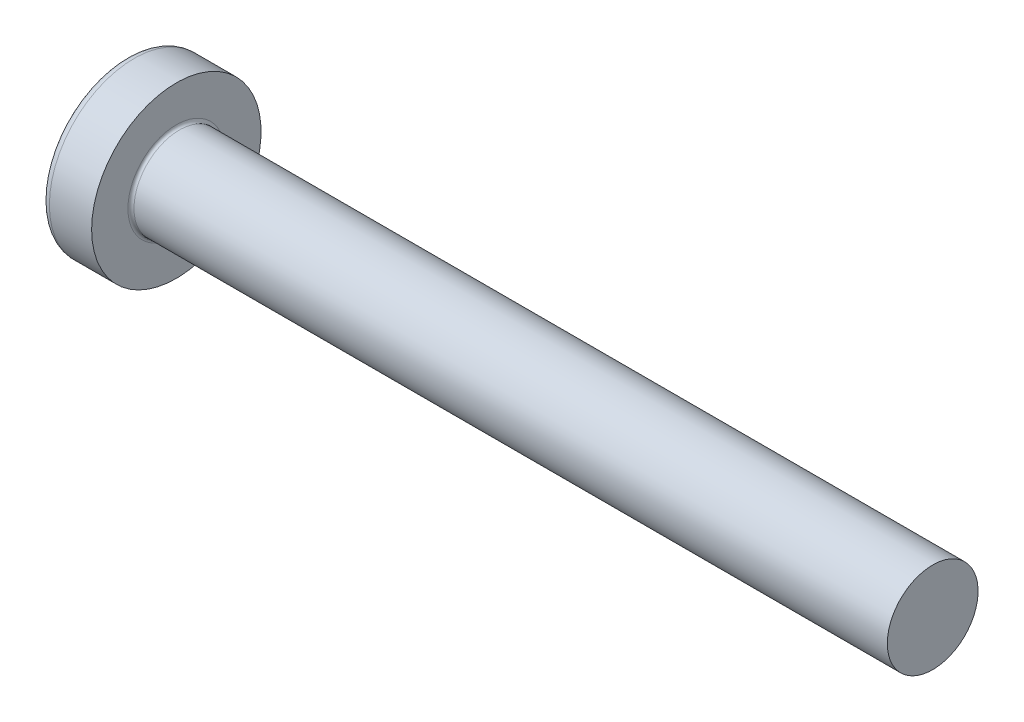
from build123d import *

# Parameters (mm, degrees)
FILLET1_R    = 0.1
RECPAT_COUNT = 2
RECPAT_ANGLE = 90


with BuildPart() as part:
    # BodySke → Base-Revolve (revolve)
    with BuildSketch(Plane.XY, mode=Mode.PRIVATE) as base_revolve_sk:
        with BuildLine():
            Line((2.4, 1.5), (2.4, 2.8))
            Line((2.4, 2.8), (1.003501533, 2.8))
            ThreePointArc((1.003501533, 2.8), (0.873295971, 2.76653015), (0.775371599, 2.674418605))
            ThreePointArc((0.775371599, 2.674418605), (0.197753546, 1.392274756), (0, 0))
            Line((0, 0), (27.4, 0))
            Line((27.4, 0), (27.4, 1.5))
            Line((27.4, 1.5), (2.4, 1.5))
        make_face()
    revolve(base_revolve_sk.sketch.rotate(Axis((1.003501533, 0, 0), (1, 0, 0)), 90), axis=Axis((1.003501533, 0, 0), (1, 0, 0)))

    # Fillet1
    fillet1_edges = [part.edges().sort_by_distance(p)[0] for p in [
        (2.4, 0, -1.5),
    ]]
    fillet(fillet1_edges, radius=FILLET1_R)

    # Sketch3 → Recess section 0
    with BuildSketch(Plane(origin=(0, 0, 0), x_dir=(0, 0, -1), z_dir=(1, 0, 0))):
        with BuildLine():
            Line((0.37, -1.4), (-0.37, -1.4))
            Line((-0.37, -1.4), (-0.37, 1.4))
            Line((-0.37, 1.4), (0.37, 1.4))
            Line((0.37, 1.4), (0.37, -1.4))
        make_face()
    # Sketch4 → Recess section 1
    with BuildSketch(Plane(origin=(1.75, 0, 0), x_dir=(0, 0, -1), z_dir=(1, 0, 0))):
        with BuildLine():
            Line((0.37, -0.527482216), (-0.37, -0.527482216))
            Line((-0.37, -0.527482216), (-0.37, 0.527482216))
            Line((-0.37, 0.527482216), (0.37, 0.527482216))
            Line((0.37, 0.527482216), (0.37, -0.527482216))
        make_face()
    recess = loft(mode=Mode.SUBTRACT)

    # RecPat: Recess ×2 about axis
    recpat_axis = Axis((0, 0, 0), (1, 0, 0))
    for i in range(1, RECPAT_COUNT):
        add(recess.rotate(recpat_axis, i * RECPAT_ANGLE / (RECPAT_COUNT - 1)), mode=Mode.SUBTRACT)

    # RecCorSke → RecessCore (revolve, cut)
    with BuildSketch(Plane.XY, mode=Mode.PRIVATE) as recesscore_sk:
        Polygon((0, 0), (0, 0.678371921), (1.75, 0.556), (1.930655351, 0), align=None)
    revolve(recesscore_sk.sketch.rotate(Axis((-3.175, 0, 0), (1, 0, 0)), 344.185974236), axis=Axis((-3.175, 0, 0), (1, 0, 0)), mode=Mode.SUBTRACT)


solid = part.part
